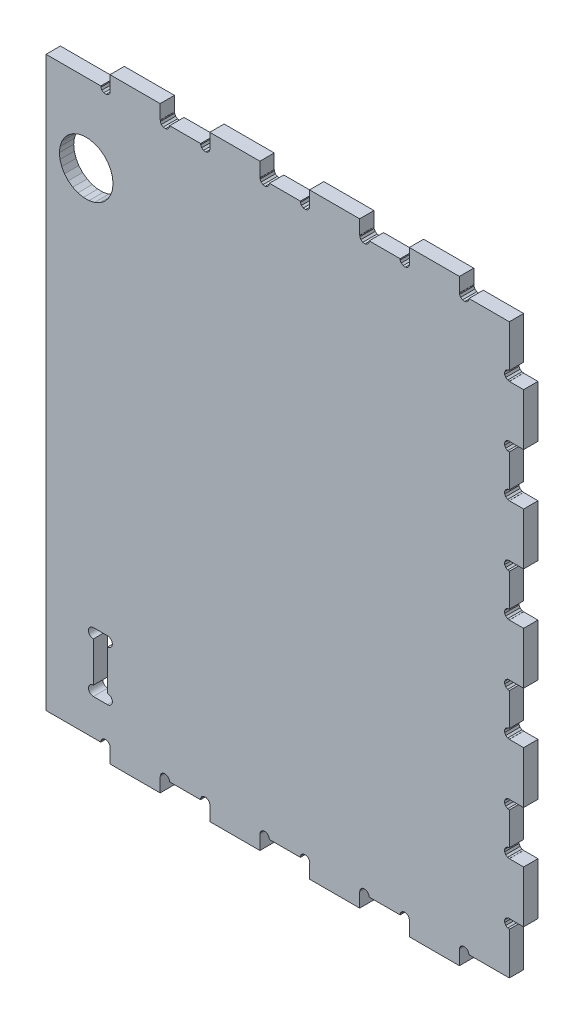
from build123d import *

# Parameters (mm, degrees)
BOSS_EXTRUDE1_DEPTH = 12


with BuildPart() as part:
    # Sketch1 → Boss-Extrude1 (new body)
    with BuildSketch(Plane.XY):
        Polygon((-104.444, -500.014289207), (-104.328, -500.014289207), (-104.328, -499.057289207), (-103.438, -497.362289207), (-101.863, -496.274289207), (-99.9623, -496.043289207), (-98.1722, -496.722289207), (-96.9026, -498.155289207), (-96.4444, -500.014289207), (-70.5504, -500.014289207), (-70.5504, -499.057289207), (-69.6607, -497.362289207), (-68.0851, -496.274289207), (-66.1845, -496.043289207), (-64.3944, -496.722289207), (-63.1248, -498.155289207), (-62.6667, -500.014289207), (-62.8667, -500.825289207), (-62.8667, -512.014289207), (-20.8889, -512.014289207), (-20.8889, -500.014289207), (-20.7726, -500.014289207), (-20.7726, -499.057289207), (-19.8829, -497.362289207), (-18.3073, -496.274289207), (-16.4067, -496.043289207), (-14.6166, -496.722289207), (-13.3471, -498.155289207), (-12.8889, -500.014289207), (13.0051, -500.014289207), (13.0051, -499.057289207), (13.8948, -497.362289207), (15.4705, -496.274289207), (17.371, -496.043289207), (19.1611, -496.722289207), (20.4307, -498.155289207), (20.8889, -500.014289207), (20.6889, -500.825289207), (20.6889, -512.014289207), (62.6667, -512.014289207), (62.6667, -500.014289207), (62.7829, -500.014289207), (62.7829, -499.057289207), (63.6726, -497.362289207), (65.2482, -496.274289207), (67.1488, -496.043289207), (68.9389, -496.722289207), (70.2085, -498.155289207), (70.6667, -500.014289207), (96.5607, -500.014289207), (96.5607, -499.057289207), (97.4504, -497.362289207), (99.026, -496.274289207), (100.927, -496.043289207), (102.717, -496.722289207), (103.986, -498.155289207), (104.444, -500.014289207), (104.244, -500.825289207), (104.244, -512.014289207), (146.222, -512.014289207), (146.222, -500.014289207), (146.338, -500.014289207), (146.338, -499.057289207), (147.228, -497.362289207), (148.804, -496.274289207), (150.704, -496.043289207), (152.494, -496.722289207), (153.764, -498.155289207), (154.222, -500.014289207), (188, -500.014289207), (188, -464.654289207), (186.582, -464.481289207), (185.006, -463.394289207), (184.116, -461.699289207), (184.116, -459.784289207), (185.006, -458.089289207), (186.582, -457.001289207), (188.482, -456.770289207), (188.933, -456.941289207), (200, -456.941289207), (200, -413.469289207), (188, -413.469289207), (188, -413.381289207), (186.582, -413.209289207), (185.006, -412.121289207), (184.116, -410.426289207), (184.116, -408.511289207), (185.006, -406.816289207), (186.582, -405.728289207), (188, -405.556289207), (188, -378.108289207), (186.582, -377.936289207), (185.006, -376.848289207), (184.116, -375.153289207), (184.116, -373.239289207), (185.006, -371.543289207), (186.582, -370.456289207), (188.482, -370.225289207), (188.933, -370.396289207), (200, -370.396289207), (200, -326.923289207), (188, -326.923289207), (188, -326.835289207), (186.582, -326.663289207), (185.006, -325.576289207), (184.116, -323.880289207), (184.116, -321.966289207), (185.006, -320.271289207), (186.582, -319.183289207), (188, -319.011289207), (188, -291.563289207), (186.582, -291.390289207), (185.006, -290.303289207), (184.116, -288.608289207), (184.116, -286.693289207), (185.006, -284.998289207), (186.582, -283.910289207), (188.482, -283.680289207), (188.933, -283.850289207), (200, -283.850289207), (200, -240.378289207), (188, -240.378289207), (188, -240.290289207), (186.582, -240.118289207), (185.006, -239.030289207), (184.116, -237.335289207), (184.116, -235.420289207), (185.006, -233.725289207), (186.582, -232.638289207), (188, -232.465289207), (188, -205.017289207), (186.582, -204.845289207), (185.006, -203.757289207), (184.116, -202.062289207), (184.116, -200.148289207), (185.006, -198.452289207), (186.582, -197.365289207), (188.482, -197.134289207), (188.933, -197.305289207), (200, -197.305289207), (200, -153.832289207), (188, -153.832289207), (188, -153.744289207), (186.582, -153.572289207), (185.006, -152.485289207), (184.116, -150.789289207), (184.116, -148.875289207), (185.006, -147.180289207), (186.582, -146.092289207), (188, -145.920289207), (188, -118.472289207), (186.582, -118.300289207), (185.006, -117.212289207), (184.116, -115.517289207), (184.116, -113.602289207), (185.006, -111.907289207), (186.582, -110.819289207), (188.482, -110.589289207), (188.933, -110.759289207), (200, -110.759289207), (200, -67.286989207), (188, -67.286989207), (188, -67.199289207), (186.582, -67.027089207), (185.006, -65.939489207), (184.116, -64.244289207), (184.116, -62.329789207), (185.006, -60.634489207), (186.582, -59.546989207), (188, -59.374689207), (188, -24.014289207), (154.222, -24.014289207), (153.764, -25.873189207), (152.494, -27.306189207), (150.704, -27.985089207), (148.804, -27.754389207), (147.228, -26.666789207), (146.338, -24.971589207), (146.338, -24.014289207), (146.222, -24.014289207), (146.222, -12.014289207), (104.244, -12.014289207), (104.244, -23.202789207), (104.444, -24.014289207), (103.986, -25.873189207), (102.717, -27.306189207), (100.927, -27.985089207), (99.026, -27.754389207), (97.4504, -26.666789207), (96.5607, -24.971589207), (96.5607, -24.014289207), (70.6667, -24.014289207), (70.2085, -25.873189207), (68.9389, -27.306189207), (67.1488, -27.985089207), (65.2482, -27.754389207), (63.6726, -26.666789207), (62.7829, -24.971589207), (62.7829, -24.014289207), (62.6667, -24.014289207), (62.6667, -12.014289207), (20.6889, -12.014289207), (20.6889, -23.202889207), (20.8889, -24.014289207), (20.4307, -25.873189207), (19.1611, -27.306189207), (17.371, -27.985089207), (15.4705, -27.754389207), (13.8948, -26.666789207), (13.0051, -24.971589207), (13.0051, -24.014289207), (-12.8889, -24.014289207), (-13.3471, -25.873189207), (-14.6166, -27.306189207), (-16.4067, -27.985089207), (-18.3073, -27.754389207), (-19.8829, -26.666789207), (-20.7726, -24.971589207), (-20.7726, -24.014289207), (-20.8889, -24.014289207), (-20.8889, -12.014289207), (-62.8667, -12.014289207), (-62.8667, -23.202889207), (-62.6667, -24.014289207), (-63.1248, -25.873189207), (-64.3944, -27.306189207), (-66.1845, -27.985089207), (-68.0851, -27.754389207), (-69.6607, -26.666789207), (-70.5504, -24.971589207), (-70.5504, -24.014289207), (-96.4444, -24.014289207), (-96.9026, -25.873189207), (-98.1722, -27.306189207), (-99.9623, -27.985089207), (-101.863, -27.754389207), (-103.438, -26.666789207), (-104.328, -24.971589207), (-104.328, -24.014289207), (-104.444, -24.014289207), (-104.444, -12.014289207), (-146.422, -12.014289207), (-146.422, -23.202889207), (-146.222, -24.014289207), (-146.68, -25.873189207), (-147.95, -27.306189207), (-149.74, -27.985089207), (-151.641, -27.754389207), (-153.216, -26.666789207), (-154.106, -24.971589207), (-154.106, -24.014289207), (-200, -24.014289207), (-200, -500.014289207), (-154.106, -500.014289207), (-154.106, -499.057289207), (-153.216, -497.362289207), (-151.641, -496.274289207), (-149.74, -496.043289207), (-147.95, -496.722289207), (-146.68, -498.155289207), (-146.222, -500.014289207), (-146.422, -500.825289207), (-146.422, -512.014289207), (-104.444, -512.014289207), align=None)
        Polygon((-168.711, -112.141168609), (-173.302, -111.166168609), (-177.59, -109.256168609), (-181.388, -106.497168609), (-184.528, -103.009168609), (-186.875, -98.944168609), (-188.326, -94.479968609), (-188.817, -89.811768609), (-188.326, -85.143568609), (-186.875, -80.679368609), (-184.528, -76.614268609), (-181.388, -73.126068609), (-177.59, -70.366968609), (-173.302, -68.457768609), (-168.711, -67.481868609), (-164.017, -67.481868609), (-159.425, -68.457768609), (-155.137, -70.366968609), (-151.34, -73.126068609), (-148.199, -76.614268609), (-145.852, -80.679368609), (-144.401, -85.143568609), (-143.911, -89.811768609), (-144.401, -94.479968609), (-145.852, -98.944168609), (-148.199, -103.009168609), (-151.34, -106.497168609), (-155.137, -109.256168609), (-159.425, -111.166168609), (-164.017, -112.141168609), align=None, mode=Mode.SUBTRACT)
        with BuildLine():
            Line((-148.564, -470.014289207), (-160.364, -470.014289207))
            ThreePointArc((-160.364, -470.014289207), (-164.464, -465.914289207), (-160.364, -461.814289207))
            Line((-160.364, -461.814289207), (-160.364, -428.214289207))
            ThreePointArc((-160.364, -428.214289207), (-164.464, -424.114289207), (-160.364, -420.014289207))
            Line((-160.364, -420.014289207), (-148.564, -420.014289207))
            ThreePointArc((-148.564, -420.014289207), (-144.464, -424.114289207), (-148.564, -428.214289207))
            Line((-148.564, -428.214289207), (-148.564, -461.814289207))
            ThreePointArc((-148.564, -461.814289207), (-144.464, -465.914289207), (-148.564, -470.014289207))
        make_face(mode=Mode.SUBTRACT)
    extrude(amount=BOSS_EXTRUDE1_DEPTH)


solid = part.part
